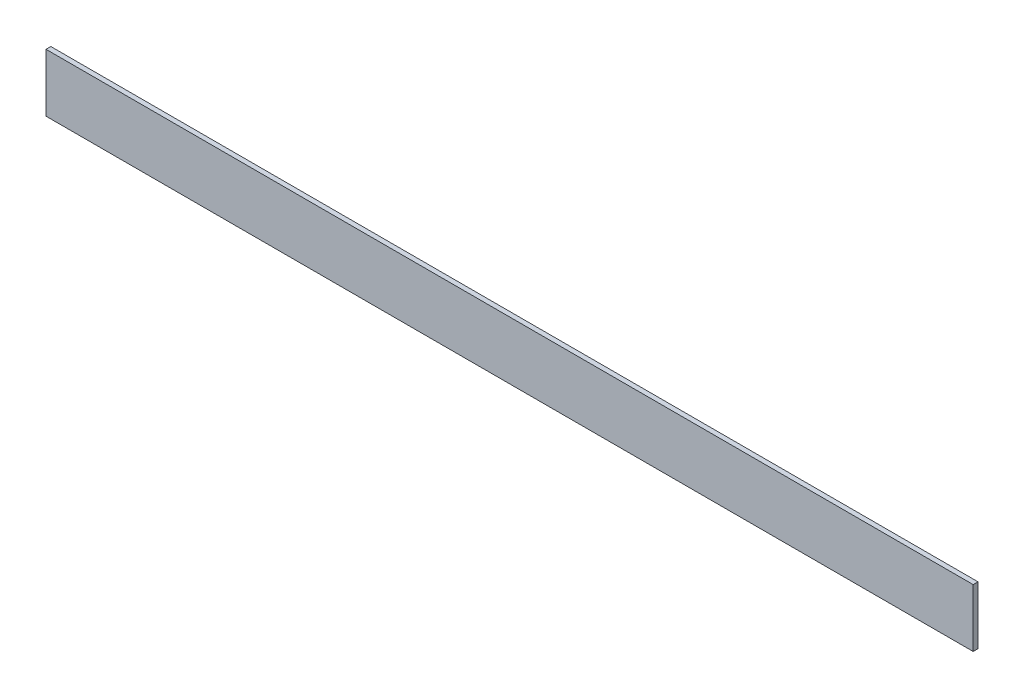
ISO-10303-21;
HEADER;
FILE_DESCRIPTION(('STEP AP214'),'2;1');
FILE_NAME('part.step','',(''),(''),'','','');
FILE_SCHEMA(('AUTOMOTIVE_DESIGN { 1 0 10303 214 1 1 1 1 }'));
ENDSEC;
DATA;
#1=APPLICATION_CONTEXT('core data for automotive mechanical design processes');
#2=APPLICATION_PROTOCOL_DEFINITION('international standard','automotive_design',2000,#1);
#3=PRODUCT_CONTEXT('',#1,'mechanical');
#4=PRODUCT('Part','Part','',(#3));
#5=PRODUCT_RELATED_PRODUCT_CATEGORY('part','',(#4));
#6=PRODUCT_DEFINITION_FORMATION('','',#4);
#7=PRODUCT_DEFINITION_CONTEXT('part definition',#1,'design');
#8=PRODUCT_DEFINITION('design','',#6,#7);
#9=PRODUCT_DEFINITION_SHAPE('','',#8);
#10=(LENGTH_UNIT() NAMED_UNIT(*) SI_UNIT(.MILLI.,.METRE.));
#11=(NAMED_UNIT(*) PLANE_ANGLE_UNIT() SI_UNIT($,.RADIAN.));
#12=(NAMED_UNIT(*) SI_UNIT($,.STERADIAN.) SOLID_ANGLE_UNIT());
#13=UNCERTAINTY_MEASURE_WITH_UNIT(LENGTH_MEASURE(1.E-05),#10,'distance_accuracy_value','');
#14=(GEOMETRIC_REPRESENTATION_CONTEXT(3) GLOBAL_UNCERTAINTY_ASSIGNED_CONTEXT((#13)) GLOBAL_UNIT_ASSIGNED_CONTEXT((#10,
#11,#12)) REPRESENTATION_CONTEXT('',''));
#15=CARTESIAN_POINT('',(0.,0.,0.));
#16=DIRECTION('',(0.,0.,1.));
#17=DIRECTION('',(1.,0.,0.));
#18=AXIS2_PLACEMENT_3D('',#15,#16,#17);
#19=CARTESIAN_POINT('',(609.6,-38.0999999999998,6.35));
#20=DIRECTION('',(-1.,0.,0.));
#21=DIRECTION('',(0.,-1.,0.));
#22=AXIS2_PLACEMENT_3D('',#19,#20,#21);
#23=PLANE('',#22);
#24=DIRECTION('',(0.,1.,0.));
#25=VECTOR('',#24,1.);
#26=CARTESIAN_POINT('',(609.6,-38.0999999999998,0.));
#27=LINE('',#26,#25);
#28=CARTESIAN_POINT('',(609.6,-38.0999999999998,0.));
#29=VERTEX_POINT('',#28);
#30=CARTESIAN_POINT('',(609.6,38.1,0.));
#31=VERTEX_POINT('',#30);
#32=EDGE_CURVE('E114',#29,#31,#27,.T.);
#33=ORIENTED_EDGE('',*,*,#32,.T.);
#34=DIRECTION('',(0.,0.,-1.));
#35=VECTOR('',#34,1.);
#36=CARTESIAN_POINT('',(609.6,38.1,6.35));
#37=LINE('',#36,#35);
#38=CARTESIAN_POINT('',(609.6,38.1,6.35));
#39=VERTEX_POINT('',#38);
#40=EDGE_CURVE('E11',#39,#31,#37,.T.);
#41=ORIENTED_EDGE('',*,*,#40,.F.);
#42=DIRECTION('',(0.,1.,0.));
#43=VECTOR('',#42,1.);
#44=CARTESIAN_POINT('',(609.6,-38.0999999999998,6.35));
#45=LINE('',#44,#43);
#46=CARTESIAN_POINT('',(609.6,-38.0999999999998,6.35));
#47=VERTEX_POINT('',#46);
#48=EDGE_CURVE('E97',#47,#39,#45,.T.);
#49=ORIENTED_EDGE('',*,*,#48,.F.);
#50=DIRECTION('',(0.,0.,-1.));
#51=VECTOR('',#50,1.);
#52=CARTESIAN_POINT('',(609.6,-38.0999999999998,6.35));
#53=LINE('',#52,#51);
#54=EDGE_CURVE('E110',#47,#29,#53,.T.);
#55=ORIENTED_EDGE('',*,*,#54,.T.);
#56=EDGE_LOOP('',(#33,#41,#49,#55));
#57=FACE_BOUND('',#56,.T.);
#58=ADVANCED_FACE('F42',(#57),#23,.F.);
#59=CARTESIAN_POINT('',(-609.6,38.1,6.35));
#60=DIRECTION('',(0.,-1.,0.));
#61=DIRECTION('',(1.,0.,0.));
#62=AXIS2_PLACEMENT_3D('',#59,#60,#61);
#63=PLANE('',#62);
#64=DIRECTION('',(-1.,0.,0.));
#65=VECTOR('',#64,1.);
#66=CARTESIAN_POINT('',(-609.6,38.1,0.));
#67=LINE('',#66,#65);
#68=CARTESIAN_POINT('',(-609.6,38.1,0.));
#69=VERTEX_POINT('',#68);
#70=EDGE_CURVE('E102',#31,#69,#67,.T.);
#71=ORIENTED_EDGE('',*,*,#70,.T.);
#72=DIRECTION('',(0.,0.,-1.));
#73=VECTOR('',#72,1.);
#74=CARTESIAN_POINT('',(-609.6,38.1,6.35));
#75=LINE('',#74,#73);
#76=CARTESIAN_POINT('',(-609.6,38.1,6.35));
#77=VERTEX_POINT('',#76);
#78=EDGE_CURVE('E50',#77,#69,#75,.T.);
#79=ORIENTED_EDGE('',*,*,#78,.F.);
#80=DIRECTION('',(-1.,0.,0.));
#81=VECTOR('',#80,1.);
#82=CARTESIAN_POINT('',(-609.6,38.1,6.35));
#83=LINE('',#82,#81);
#84=EDGE_CURVE('E92',#39,#77,#83,.T.);
#85=ORIENTED_EDGE('',*,*,#84,.F.);
#86=ORIENTED_EDGE('',*,*,#40,.T.);
#87=EDGE_LOOP('',(#71,#79,#85,#86));
#88=FACE_BOUND('',#87,.T.);
#89=ADVANCED_FACE('F101',(#88),#63,.F.);
#90=CARTESIAN_POINT('',(-609.6,-38.1,6.35));
#91=DIRECTION('',(1.,0.,0.));
#92=DIRECTION('',(0.,0.,-1.));
#93=AXIS2_PLACEMENT_3D('',#90,#91,#92);
#94=PLANE('',#93);
#95=DIRECTION('',(0.,-1.,0.));
#96=VECTOR('',#95,1.);
#97=CARTESIAN_POINT('',(-609.6,-38.1,0.));
#98=LINE('',#97,#96);
#99=CARTESIAN_POINT('',(-609.6,-38.1,0.));
#100=VERTEX_POINT('',#99);
#101=EDGE_CURVE('E79',#69,#100,#98,.T.);
#102=ORIENTED_EDGE('',*,*,#101,.T.);
#103=DIRECTION('',(0.,0.,-1.));
#104=VECTOR('',#103,1.);
#105=CARTESIAN_POINT('',(-609.6,-38.1,6.35));
#106=LINE('',#105,#104);
#107=CARTESIAN_POINT('',(-609.6,-38.1,6.35));
#108=VERTEX_POINT('',#107);
#109=EDGE_CURVE('E104',#108,#100,#106,.T.);
#110=ORIENTED_EDGE('',*,*,#109,.F.);
#111=DIRECTION('',(0.,-1.,0.));
#112=VECTOR('',#111,1.);
#113=CARTESIAN_POINT('',(-609.6,-38.1,6.35));
#114=LINE('',#113,#112);
#115=EDGE_CURVE('E95',#77,#108,#114,.T.);
#116=ORIENTED_EDGE('',*,*,#115,.F.);
#117=ORIENTED_EDGE('',*,*,#78,.T.);
#118=EDGE_LOOP('',(#102,#110,#116,#117));
#119=FACE_BOUND('',#118,.T.);
#120=ADVANCED_FACE('F105',(#119),#94,.F.);
#121=CARTESIAN_POINT('',(-609.6,-38.1,6.35));
#122=DIRECTION('',(0.,1.,0.));
#123=DIRECTION('',(-1.,0.,0.));
#124=AXIS2_PLACEMENT_3D('',#121,#122,#123);
#125=PLANE('',#124);
#126=DIRECTION('',(1.,0.,0.));
#127=VECTOR('',#126,1.);
#128=CARTESIAN_POINT('',(-609.6,-38.1,0.));
#129=LINE('',#128,#127);
#130=EDGE_CURVE('E85',#100,#29,#129,.T.);
#131=ORIENTED_EDGE('',*,*,#130,.T.);
#132=ORIENTED_EDGE('',*,*,#54,.F.);
#133=DIRECTION('',(1.,0.,0.));
#134=VECTOR('',#133,1.);
#135=CARTESIAN_POINT('',(-609.6,-38.1,6.35));
#136=LINE('',#135,#134);
#137=EDGE_CURVE('E58',#108,#47,#136,.T.);
#138=ORIENTED_EDGE('',*,*,#137,.F.);
#139=ORIENTED_EDGE('',*,*,#109,.T.);
#140=EDGE_LOOP('',(#131,#132,#138,#139));
#141=FACE_BOUND('',#140,.T.);
#142=ADVANCED_FACE('F124',(#141),#125,.F.);
#143=CARTESIAN_POINT('',(0.,0.,6.35));
#144=DIRECTION('',(0.,0.,-1.));
#145=DIRECTION('',(-1.,0.,0.));
#146=AXIS2_PLACEMENT_3D('',#143,#144,#145);
#147=PLANE('',#146);
#148=ORIENTED_EDGE('',*,*,#48,.T.);
#149=ORIENTED_EDGE('',*,*,#84,.T.);
#150=ORIENTED_EDGE('',*,*,#115,.T.);
#151=ORIENTED_EDGE('',*,*,#137,.T.);
#152=EDGE_LOOP('',(#148,#149,#150,#151));
#153=FACE_BOUND('',#152,.T.);
#154=ADVANCED_FACE('F93',(#153),#147,.F.);
#155=CARTESIAN_POINT('',(0.,0.,0.));
#156=DIRECTION('',(0.,0.,-1.));
#157=DIRECTION('',(-1.,0.,0.));
#158=AXIS2_PLACEMENT_3D('',#155,#156,#157);
#159=PLANE('',#158);
#160=ORIENTED_EDGE('',*,*,#32,.F.);
#161=ORIENTED_EDGE('',*,*,#130,.F.);
#162=ORIENTED_EDGE('',*,*,#101,.F.);
#163=ORIENTED_EDGE('',*,*,#70,.F.);
#164=EDGE_LOOP('',(#160,#161,#162,#163));
#165=FACE_BOUND('',#164,.T.);
#166=ADVANCED_FACE('F127',(#165),#159,.T.);
#167=CLOSED_SHELL('',(#58,#89,#120,#142,#154,#166));
#168=MANIFOLD_SOLID_BREP('B2',#167);
#169=ADVANCED_BREP_SHAPE_REPRESENTATION('',(#18,#168),#14);
#170=SHAPE_DEFINITION_REPRESENTATION(#9,#169);
ENDSEC;
END-ISO-10303-21;
